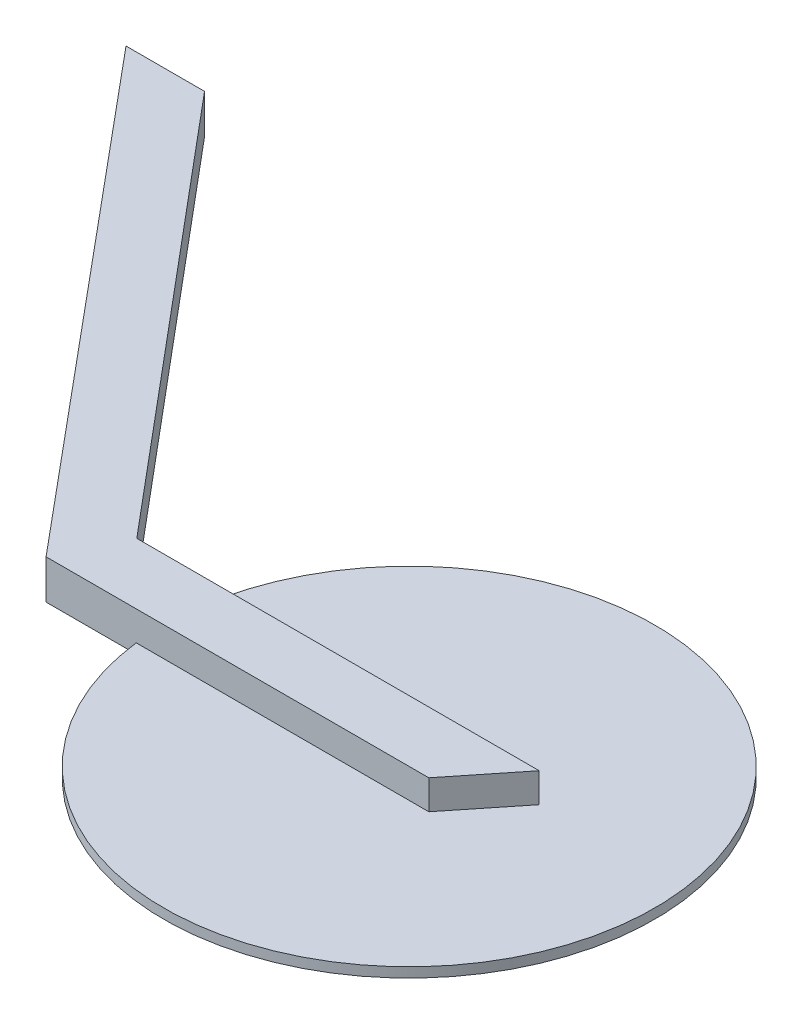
from build123d import *

# Parameters (mm, degrees)
BOSS_EXTRU_1_DEPTH = 4
ESQUISSE2_R        = 25
BOSS_EXTRU_2_DEPTH = 1


with BuildPart() as part:
    # Esquisse1 → Boss.-Extru.1 (new body)
    with BuildSketch(Plane(origin=(0, 0, 0), x_dir=(1, 0, 0), z_dir=(0, 1, 0))):
        Polygon((0, 0), (8, 0), (43.995338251, -42.897573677), (84.995338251, -42.897573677), (79.997765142, -49.14451397), (40.997765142, -49.14451397), align=None)
    extrude(amount=BOSS_EXTRU_1_DEPTH)

    # Esquisse2 → Boss.-Extru.2 (add)
    with BuildSketch(Plane.XZ):
        with Locations((75, 46.14451397)):
            Circle(ESQUISSE2_R)
    extrude(amount=-BOSS_EXTRU_2_DEPTH)


solid = part.part
